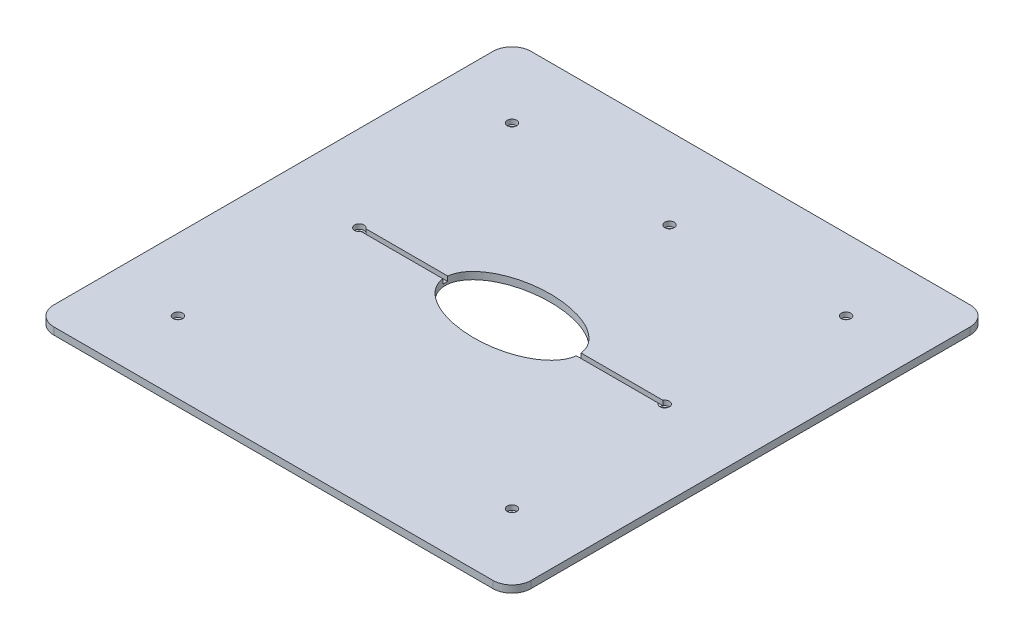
from build123d import *

# Parameters (mm, degrees)
EXTRUDE_1_DEPTH      = 1.5
SKETCH_3_R           = 1
CUT_EXTRUDE_1_DEPTH  = 1
SKETCH_4_R           = 0.805
CUT_EXTRUDE_2_DEPTH  = 1
SKETCH_2_RX          = 14
SKETCH_2_RY          = 8
CUT_EXTRUDE_4_DEPTH  = 71.726586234
SKETCH_7_W           = 64
SKETCH_7_H           = 1
CUT_EXTRUDE_6_DEPTH  = 1
SKETCH_10_R          = 1
CUT_EXTRUDE_7_DEPTH  = 1
SKETCH_11_R          = 0.805
CUT_EXTRUDE_8_DEPTH  = 1
SKETCH_13_R          = 1
CUT_EXTRUDE_10_DEPTH = 1
SKETCH_14_R          = 0.805
CUT_EXTRUDE_11_DEPTH = 1


with BuildPart() as part:
    # Sketch 1 → Extrude 1 (new body)
    with BuildSketch(Plane(origin=(0, 0, 0), x_dir=(1, 0, 0), z_dir=(0, 1, 0))):
        with BuildLine():
            Line((46, -50), (-46, -50))
            ThreePointArc((-46, -50), (-48.828427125, -48.828427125), (-50, -46))
            Line((-50, -46), (-50, 46))
            ThreePointArc((-50, 46), (-48.828427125, 48.828427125), (-46, 50))
            Line((-46, 50), (46, 50))
            ThreePointArc((46, 50), (48.828427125, 48.828427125), (50, 46))
            Line((50, 46), (50, -46))
            ThreePointArc((50, -46), (48.828427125, -48.828427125), (46, -50))
        make_face()
    extrude(amount=EXTRUDE_1_DEPTH)

    # Sketch 3 → Cut-Extrude 1 (cut)
    with BuildSketch(Plane(origin=(0, 1.5, 0), x_dir=(1, 0, 0), z_dir=(0, 1, 0))):
        with Locations(Location((-35, 35, 0), (0, 0, 270))):
            Circle(SKETCH_3_R)
        with Locations(Location((35, 35, 0), (0, 0, 270))):
            Circle(SKETCH_3_R)
        with Locations(Location((35, -35, 0), (0, 0, 270))):
            Circle(SKETCH_3_R)
        with Locations(Location((-35, -35, 0), (0, 0, 270))):
            Circle(SKETCH_3_R)
    extrude(amount=-CUT_EXTRUDE_1_DEPTH, mode=Mode.SUBTRACT)

    # Sketch 4 → Cut-Extrude 2 (cut)
    with BuildSketch(Plane(origin=(0, 0.5, 0), x_dir=(1, 0, 0), z_dir=(0, 1, 0))):
        with Locations(Location((-35, 35, 0), (0, 0, 270))):
            Circle(SKETCH_4_R)
        with Locations(Location((35, 35, 0), (0, 0, 270))):
            Circle(SKETCH_4_R)
        with Locations(Location((35, -35, 0), (0, 0, 270))):
            Circle(SKETCH_4_R)
        with Locations(Location((-35, -35, 0), (0, 0, 270))):
            Circle(SKETCH_4_R)
    extrude(amount=-CUT_EXTRUDE_2_DEPTH, mode=Mode.SUBTRACT)

    # Cut-Extrude 3 cone 1 section (on through the dimple's axis) → Cut-Extrude 3 (revolve, cut)
    with BuildSketch(Plane(origin=(-35, 0.5, -35), x_dir=(0, 0, 1), z_dir=(1, 0, 0))):
        Polygon((0, 0), (1, 0), (0, 1), align=None)
    revolve(axis=Axis((-35, 0.5, -35), (0, -1, 0)), mode=Mode.SUBTRACT)

    # Cut-Extrude 3 cone 2 section (on through the dimple's axis) → Cut-Extrude 3 cone 2 (revolve, cut)
    with BuildSketch(Plane(origin=(35, 0.5, -35), x_dir=(0, 0, 1), z_dir=(1, 0, 0))):
        Polygon((0, 0), (1, 0), (0, 1), align=None)
    revolve(axis=Axis((35, 0.5, -35), (0, -1, 0)), mode=Mode.SUBTRACT)

    # Cut-Extrude 3 cone 3 section (on through the dimple's axis) → Cut-Extrude 3 cone 3 (revolve, cut)
    with BuildSketch(Plane(origin=(35, 0.5, 35), x_dir=(0, 0, 1), z_dir=(1, 0, 0))):
        Polygon((0, 0), (1, 0), (0, 1), align=None)
    revolve(axis=Axis((35, 0.5, 35), (0, -1, 0)), mode=Mode.SUBTRACT)

    # Cut-Extrude 3 cone 4 section (on through the dimple's axis) → Cut-Extrude 3 cone 4 (revolve, cut)
    with BuildSketch(Plane(origin=(-35, 0.5, 35), x_dir=(0, 0, 1), z_dir=(1, 0, 0))):
        Polygon((0, 0), (1, 0), (0, 1), align=None)
    revolve(axis=Axis((-35, 0.5, 35), (0, -1, 0)), mode=Mode.SUBTRACT)

    # Sketch 2 → Cut-Extrude 4 (cut, through all)
    with BuildSketch(Plane(origin=(0, 1.5, 0), x_dir=(1, 0, 0), z_dir=(0, 1, 0))):
        with Locations(Location((0, 0), (0, 0, 180))):
            Ellipse(SKETCH_2_RX, SKETCH_2_RY)
    extrude(amount=-CUT_EXTRUDE_4_DEPTH, mode=Mode.SUBTRACT)

    # Sketch 7 → Cut-Extrude 6 (cut)
    with BuildSketch(Plane(origin=(0, 1.5, 0), x_dir=(1, 0, 0), z_dir=(0, 1, 0))):
        Rectangle(SKETCH_7_W, SKETCH_7_H)
    extrude(amount=-CUT_EXTRUDE_6_DEPTH, mode=Mode.SUBTRACT)

    # Sketch 10 → Cut-Extrude 7 (cut)
    with BuildSketch(Plane(origin=(0, 1.5, 0), x_dir=(1, 0, 0), z_dir=(0, 1, 0))):
        with Locations((-32, 0)):
            Circle(SKETCH_10_R)
        with Locations((32, 0)):
            Circle(SKETCH_10_R)
    extrude(amount=-CUT_EXTRUDE_7_DEPTH, mode=Mode.SUBTRACT)

    # Sketch 11 → Cut-Extrude 8 (cut)
    with BuildSketch(Plane(origin=(0, 0.5, 0), x_dir=(1, 0, 0), z_dir=(0, 1, 0))):
        with Locations(Location((32, 0, 0), (0, 0, 270))):
            Circle(SKETCH_11_R)
        with Locations(Location((-32, 0, 0), (0, 0, 270))):
            Circle(SKETCH_11_R)
    extrude(amount=-CUT_EXTRUDE_8_DEPTH, mode=Mode.SUBTRACT)

    # Cut-Extrude 9 cone 1 section (on through the dimple's axis) → Cut-Extrude 9 (revolve, cut)
    with BuildSketch(Plane(origin=(-32, 0.5, 0), x_dir=(0, 0, 1), z_dir=(1, 0, 0))):
        Polygon((0, 0), (1, 0), (0, 1), align=None)
    revolve(axis=Axis((-32, 0.5, 0), (0, -1, 0)), mode=Mode.SUBTRACT)

    # Cut-Extrude 9 cone 2 section (on through the dimple's axis) → Cut-Extrude 9 cone 2 (revolve, cut)
    with BuildSketch(Plane(origin=(32, 0.5, 0), x_dir=(0, 0, 1), z_dir=(1, 0, 0))):
        Polygon((0, 0), (1, 0), (0, 1), align=None)
    revolve(axis=Axis((32, 0.5, 0), (0, -1, 0)), mode=Mode.SUBTRACT)

    # Sketch 13 → Cut-Extrude 10 (cut)
    with BuildSketch(Plane(origin=(0, 1.5, 0), x_dir=(1, 0, 0), z_dir=(0, 1, 0))):
        with Locations(Location((0, 33, 0), (0, 0, 270))):
            Circle(SKETCH_13_R)
    extrude(amount=-CUT_EXTRUDE_10_DEPTH, mode=Mode.SUBTRACT)

    # Sketch 14 → Cut-Extrude 11 (cut)
    with BuildSketch(Plane(origin=(0, 0.5, 0), x_dir=(1, 0, 0), z_dir=(0, 1, 0))):
        with Locations(Location((0, 33, 0), (0, 0, 270))):
            Circle(SKETCH_14_R)
    extrude(amount=-CUT_EXTRUDE_11_DEPTH, mode=Mode.SUBTRACT)

    # Cut-Extrude 12 cone 1 section (on through the dimple's axis) → Cut-Extrude 12 (revolve, cut)
    with BuildSketch(Plane(origin=(0, 0.5, -33), x_dir=(0, 0, 1), z_dir=(1, 0, 0))):
        Polygon((0, 0), (1, 0), (0, 1), align=None)
    revolve(axis=Axis((0, 0.5, -33), (0, -1, 0)), mode=Mode.SUBTRACT)


solid = part.part
